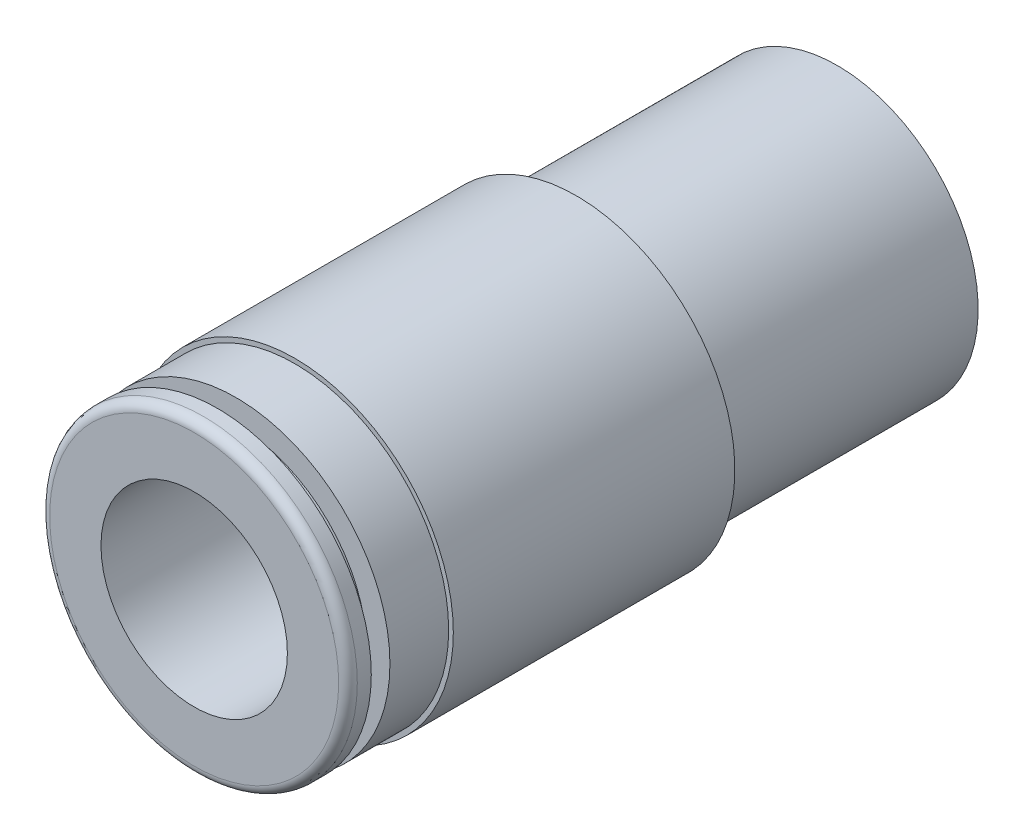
ISO-10303-21;
HEADER;
FILE_DESCRIPTION(('STEP AP214'),'2;1');
FILE_NAME('part.step','',(''),(''),'','','');
FILE_SCHEMA(('AUTOMOTIVE_DESIGN { 1 0 10303 214 1 1 1 1 }'));
ENDSEC;
DATA;
#1=APPLICATION_CONTEXT('core data for automotive mechanical design processes');
#2=APPLICATION_PROTOCOL_DEFINITION('international standard','automotive_design',2000,#1);
#3=PRODUCT_CONTEXT('',#1,'mechanical');
#4=PRODUCT('Part','Part','',(#3));
#5=PRODUCT_RELATED_PRODUCT_CATEGORY('part','',(#4));
#6=PRODUCT_DEFINITION_FORMATION('','',#4);
#7=PRODUCT_DEFINITION_CONTEXT('part definition',#1,'design');
#8=PRODUCT_DEFINITION('design','',#6,#7);
#9=PRODUCT_DEFINITION_SHAPE('','',#8);
#10=(LENGTH_UNIT() NAMED_UNIT(*) SI_UNIT(.MILLI.,.METRE.));
#11=(NAMED_UNIT(*) PLANE_ANGLE_UNIT() SI_UNIT($,.RADIAN.));
#12=(NAMED_UNIT(*) SI_UNIT($,.STERADIAN.) SOLID_ANGLE_UNIT());
#13=UNCERTAINTY_MEASURE_WITH_UNIT(LENGTH_MEASURE(1.E-05),#10,'distance_accuracy_value','');
#14=(GEOMETRIC_REPRESENTATION_CONTEXT(3) GLOBAL_UNCERTAINTY_ASSIGNED_CONTEXT((#13)) GLOBAL_UNIT_ASSIGNED_CONTEXT((#10,
#11,#12)) REPRESENTATION_CONTEXT('',''));
#15=CARTESIAN_POINT('',(0.,0.,0.));
#16=DIRECTION('',(0.,0.,1.));
#17=DIRECTION('',(1.,0.,0.));
#18=AXIS2_PLACEMENT_3D('',#15,#16,#17);
#19=CARTESIAN_POINT('',(0.,0.,0.));
#20=DIRECTION('',(0.,0.,1.));
#21=DIRECTION('',(1.,0.,0.));
#22=AXIS2_PLACEMENT_3D('',#19,#20,#21);
#23=PLANE('',#22);
#24=CARTESIAN_POINT('',(0.,0.,0.));
#25=DIRECTION('',(0.,0.,1.));
#26=DIRECTION('',(1.,0.,0.));
#27=AXIS2_PLACEMENT_3D('',#24,#25,#26);
#28=CIRCLE('',#27,5.);
#29=CARTESIAN_POINT('',(5.,0.,0.));
#30=VERTEX_POINT('',#29);
#31=EDGE_CURVE('E45',#30,#30,#28,.T.);
#32=ORIENTED_EDGE('',*,*,#31,.T.);
#33=EDGE_LOOP('',(#32));
#34=FACE_BOUND('',#33,.T.);
#35=CARTESIAN_POINT('',(0.,0.,0.));
#36=DIRECTION('',(0.,0.,-1.));
#37=DIRECTION('',(-1.,0.,0.));
#38=AXIS2_PLACEMENT_3D('',#35,#36,#37);
#39=CIRCLE('',#38,7.55);
#40=CARTESIAN_POINT('',(-7.55,0.,0.));
#41=VERTEX_POINT('',#40);
#42=EDGE_CURVE('E66',#41,#41,#39,.T.);
#43=ORIENTED_EDGE('',*,*,#42,.T.);
#44=EDGE_LOOP('',(#43));
#45=FACE_BOUND('',#44,.T.);
#46=ADVANCED_FACE('F28',(#34,#45),#23,.F.);
#47=CARTESIAN_POINT('',(0.,0.,29.1));
#48=DIRECTION('',(0.,0.,-1.));
#49=DIRECTION('',(-1.,0.,0.));
#50=AXIS2_PLACEMENT_3D('',#47,#48,#49);
#51=CYLINDRICAL_SURFACE('',#50,8.5);
#52=CARTESIAN_POINT('',(0.,0.,29.1));
#53=DIRECTION('',(0.,0.,1.));
#54=DIRECTION('',(1.,0.,0.));
#55=AXIS2_PLACEMENT_3D('',#52,#53,#54);
#56=CIRCLE('',#55,8.5);
#57=CARTESIAN_POINT('',(8.5,0.,29.1));
#58=VERTEX_POINT('',#57);
#59=EDGE_CURVE('E40',#58,#58,#56,.T.);
#60=ORIENTED_EDGE('',*,*,#59,.F.);
#61=EDGE_LOOP('',(#60));
#62=FACE_BOUND('',#61,.T.);
#63=CARTESIAN_POINT('',(0.,0.,14.));
#64=DIRECTION('',(0.,0.,-1.));
#65=DIRECTION('',(-1.,0.,0.));
#66=AXIS2_PLACEMENT_3D('',#63,#64,#65);
#67=CIRCLE('',#66,8.5);
#68=CARTESIAN_POINT('',(-8.5,0.,14.));
#69=VERTEX_POINT('',#68);
#70=EDGE_CURVE('E32',#69,#69,#67,.T.);
#71=ORIENTED_EDGE('',*,*,#70,.F.);
#72=EDGE_LOOP('',(#71));
#73=FACE_BOUND('',#72,.T.);
#74=ADVANCED_FACE('F78',(#62,#73),#51,.T.);
#75=CARTESIAN_POINT('',(0.,0.,32.25));
#76=DIRECTION('',(0.,0.,1.));
#77=DIRECTION('',(1.,0.,0.));
#78=AXIS2_PLACEMENT_3D('',#75,#76,#77);
#79=PLANE('',#78);
#80=CARTESIAN_POINT('',(0.,0.,32.25));
#81=DIRECTION('',(0.,0.,1.));
#82=DIRECTION('',(1.,0.,0.));
#83=AXIS2_PLACEMENT_3D('',#80,#81,#82);
#84=CIRCLE('',#83,8.25);
#85=CARTESIAN_POINT('',(8.25,0.,32.25));
#86=VERTEX_POINT('',#85);
#87=EDGE_CURVE('E48',#86,#86,#84,.T.);
#88=ORIENTED_EDGE('',*,*,#87,.T.);
#89=EDGE_LOOP('',(#88));
#90=FACE_BOUND('',#89,.T.);
#91=CARTESIAN_POINT('',(0.,0.,32.25));
#92=DIRECTION('',(0.,0.,1.));
#93=DIRECTION('',(1.,0.,0.));
#94=AXIS2_PLACEMENT_3D('',#91,#92,#93);
#95=CIRCLE('',#94,7.);
#96=CARTESIAN_POINT('',(7.,0.,32.25));
#97=VERTEX_POINT('',#96);
#98=EDGE_CURVE('E55',#97,#97,#95,.T.);
#99=ORIENTED_EDGE('',*,*,#98,.F.);
#100=EDGE_LOOP('',(#99));
#101=FACE_BOUND('',#100,.T.);
#102=ADVANCED_FACE('F80',(#90,#101),#79,.T.);
#103=CARTESIAN_POINT('',(0.,0.,29.1));
#104=DIRECTION('',(0.,0.,1.));
#105=DIRECTION('',(1.,0.,0.));
#106=AXIS2_PLACEMENT_3D('',#103,#104,#105);
#107=PLANE('',#106);
#108=ORIENTED_EDGE('',*,*,#59,.T.);
#109=EDGE_LOOP('',(#108));
#110=FACE_BOUND('',#109,.T.);
#111=CARTESIAN_POINT('',(0.,0.,29.1));
#112=DIRECTION('',(0.,0.,1.));
#113=DIRECTION('',(1.,0.,0.));
#114=AXIS2_PLACEMENT_3D('',#111,#112,#113);
#115=CIRCLE('',#114,8.25);
#116=CARTESIAN_POINT('',(8.25,0.,29.1));
#117=VERTEX_POINT('',#116);
#118=EDGE_CURVE('E49',#117,#117,#115,.T.);
#119=ORIENTED_EDGE('',*,*,#118,.F.);
#120=EDGE_LOOP('',(#119));
#121=FACE_BOUND('',#120,.T.);
#122=ADVANCED_FACE('F86',(#110,#121),#107,.T.);
#123=CARTESIAN_POINT('',(0.,0.,29.1));
#124=DIRECTION('',(0.,0.,-1.));
#125=DIRECTION('',(-1.,0.,0.));
#126=AXIS2_PLACEMENT_3D('',#123,#124,#125);
#127=CYLINDRICAL_SURFACE('',#126,5.);
#128=ORIENTED_EDGE('',*,*,#31,.F.);
#129=EDGE_LOOP('',(#128));
#130=FACE_BOUND('',#129,.T.);
#131=CARTESIAN_POINT('',(0.,0.,34.5));
#132=DIRECTION('',(0.,0.,1.));
#133=DIRECTION('',(1.,0.,0.));
#134=AXIS2_PLACEMENT_3D('',#131,#132,#133);
#135=CIRCLE('',#134,5.);
#136=CARTESIAN_POINT('',(5.,0.,34.5));
#137=VERTEX_POINT('',#136);
#138=EDGE_CURVE('E63',#137,#137,#135,.T.);
#139=ORIENTED_EDGE('',*,*,#138,.T.);
#140=EDGE_LOOP('',(#139));
#141=FACE_BOUND('',#140,.T.);
#142=ADVANCED_FACE('F95',(#130,#141),#127,.F.);
#143=CARTESIAN_POINT('',(0.,0.,32.25));
#144=DIRECTION('',(0.,0.,-1.));
#145=DIRECTION('',(-1.,0.,0.));
#146=AXIS2_PLACEMENT_3D('',#143,#144,#145);
#147=CYLINDRICAL_SURFACE('',#146,8.25);
#148=ORIENTED_EDGE('',*,*,#87,.F.);
#149=EDGE_LOOP('',(#148));
#150=FACE_BOUND('',#149,.T.);
#151=ORIENTED_EDGE('',*,*,#118,.T.);
#152=EDGE_LOOP('',(#151));
#153=FACE_BOUND('',#152,.T.);
#154=ADVANCED_FACE('F99',(#150,#153),#147,.T.);
#155=CARTESIAN_POINT('',(0.,0.,33.25));
#156=DIRECTION('',(0.,0.,-1.));
#157=DIRECTION('',(-1.,0.,0.));
#158=AXIS2_PLACEMENT_3D('',#155,#156,#157);
#159=CYLINDRICAL_SURFACE('',#158,7.);
#160=CARTESIAN_POINT('',(0.,0.,33.25));
#161=DIRECTION('',(0.,0.,1.));
#162=DIRECTION('',(1.,0.,0.));
#163=AXIS2_PLACEMENT_3D('',#160,#161,#162);
#164=CIRCLE('',#163,7.);
#165=CARTESIAN_POINT('',(7.,0.,33.25));
#166=VERTEX_POINT('',#165);
#167=EDGE_CURVE('E52',#166,#166,#164,.T.);
#168=ORIENTED_EDGE('',*,*,#167,.F.);
#169=EDGE_LOOP('',(#168));
#170=FACE_BOUND('',#169,.T.);
#171=ORIENTED_EDGE('',*,*,#98,.T.);
#172=EDGE_LOOP('',(#171));
#173=FACE_BOUND('',#172,.T.);
#174=ADVANCED_FACE('F102',(#170,#173),#159,.T.);
#175=CARTESIAN_POINT('',(0.,0.,33.25));
#176=DIRECTION('',(0.,0.,1.));
#177=DIRECTION('',(1.,0.,0.));
#178=AXIS2_PLACEMENT_3D('',#175,#176,#177);
#179=PLANE('',#178);
#180=CARTESIAN_POINT('',(0.,0.,33.25));
#181=DIRECTION('',(0.,0.,1.));
#182=DIRECTION('',(1.,0.,0.));
#183=AXIS2_PLACEMENT_3D('',#180,#181,#182);
#184=CIRCLE('',#183,8.25);
#185=CARTESIAN_POINT('',(8.25,0.,33.25));
#186=VERTEX_POINT('',#185);
#187=EDGE_CURVE('E58',#186,#186,#184,.T.);
#188=ORIENTED_EDGE('',*,*,#187,.F.);
#189=EDGE_LOOP('',(#188));
#190=FACE_BOUND('',#189,.T.);
#191=ORIENTED_EDGE('',*,*,#167,.T.);
#192=EDGE_LOOP('',(#191));
#193=FACE_BOUND('',#192,.T.);
#194=ADVANCED_FACE('F107',(#190,#193),#179,.F.);
#195=CARTESIAN_POINT('',(0.,0.,34.5));
#196=DIRECTION('',(0.,0.,1.));
#197=DIRECTION('',(1.,0.,0.));
#198=AXIS2_PLACEMENT_3D('',#195,#196,#197);
#199=PLANE('',#198);
#200=CARTESIAN_POINT('',(0.,0.,34.5));
#201=DIRECTION('',(0.,0.,1.));
#202=DIRECTION('',(1.,0.,0.));
#203=AXIS2_PLACEMENT_3D('',#200,#201,#202);
#204=CIRCLE('',#203,7.75);
#205=CARTESIAN_POINT('',(7.75,0.,34.5));
#206=VERTEX_POINT('',#205);
#207=EDGE_CURVE('E36',#206,#206,#204,.T.);
#208=ORIENTED_EDGE('',*,*,#207,.T.);
#209=EDGE_LOOP('',(#208));
#210=FACE_BOUND('',#209,.T.);
#211=ORIENTED_EDGE('',*,*,#138,.F.);
#212=EDGE_LOOP('',(#211));
#213=FACE_BOUND('',#212,.T.);
#214=ADVANCED_FACE('F112',(#210,#213),#199,.T.);
#215=CARTESIAN_POINT('',(0.,0.,34.5));
#216=DIRECTION('',(0.,0.,-1.));
#217=DIRECTION('',(-1.,0.,0.));
#218=AXIS2_PLACEMENT_3D('',#215,#216,#217);
#219=CYLINDRICAL_SURFACE('',#218,8.25);
#220=CARTESIAN_POINT('',(0.,0.,34.));
#221=DIRECTION('',(0.,0.,1.));
#222=DIRECTION('',(1.,0.,0.));
#223=AXIS2_PLACEMENT_3D('',#220,#221,#222);
#224=CIRCLE('',#223,8.25);
#225=CARTESIAN_POINT('',(8.25,0.,34.));
#226=VERTEX_POINT('',#225);
#227=EDGE_CURVE('E10',#226,#226,#224,.F.);
#228=ORIENTED_EDGE('',*,*,#227,.T.);
#229=EDGE_LOOP('',(#228));
#230=FACE_BOUND('',#229,.T.);
#231=ORIENTED_EDGE('',*,*,#187,.T.);
#232=EDGE_LOOP('',(#231));
#233=FACE_BOUND('',#232,.T.);
#234=ADVANCED_FACE('F109',(#230,#233),#219,.T.);
#235=CARTESIAN_POINT('',(0.,0.,34.));
#236=DIRECTION('',(0.,0.,1.));
#237=DIRECTION('',(1.,0.,0.));
#238=AXIS2_PLACEMENT_3D('',#235,#236,#237);
#239=TOROIDAL_SURFACE('',#238,7.75,0.5);
#240=ORIENTED_EDGE('',*,*,#227,.F.);
#241=EDGE_LOOP('',(#240));
#242=FACE_BOUND('',#241,.T.);
#243=ORIENTED_EDGE('',*,*,#207,.F.);
#244=EDGE_LOOP('',(#243));
#245=FACE_BOUND('',#244,.T.);
#246=ADVANCED_FACE('F30',(#242,#245),#239,.T.);
#247=CARTESIAN_POINT('',(0.,0.,14.));
#248=DIRECTION('',(0.,0.,-1.));
#249=DIRECTION('',(-1.,0.,0.));
#250=AXIS2_PLACEMENT_3D('',#247,#248,#249);
#251=PLANE('',#250);
#252=CARTESIAN_POINT('',(0.,0.,14.));
#253=DIRECTION('',(0.,0.,-1.));
#254=DIRECTION('',(-1.,0.,0.));
#255=AXIS2_PLACEMENT_3D('',#252,#253,#254);
#256=CIRCLE('',#255,7.55);
#257=CARTESIAN_POINT('',(-7.55,0.,14.));
#258=VERTEX_POINT('',#257);
#259=EDGE_CURVE('E69',#258,#258,#256,.T.);
#260=ORIENTED_EDGE('',*,*,#259,.F.);
#261=EDGE_LOOP('',(#260));
#262=FACE_BOUND('',#261,.T.);
#263=ORIENTED_EDGE('',*,*,#70,.T.);
#264=EDGE_LOOP('',(#263));
#265=FACE_BOUND('',#264,.T.);
#266=ADVANCED_FACE('F76',(#262,#265),#251,.T.);
#267=CARTESIAN_POINT('',(0.,0.,14.));
#268=DIRECTION('',(0.,0.,-1.));
#269=DIRECTION('',(-1.,0.,0.));
#270=AXIS2_PLACEMENT_3D('',#267,#268,#269);
#271=CYLINDRICAL_SURFACE('',#270,7.55);
#272=ORIENTED_EDGE('',*,*,#259,.T.);
#273=EDGE_LOOP('',(#272));
#274=FACE_BOUND('',#273,.T.);
#275=ORIENTED_EDGE('',*,*,#42,.F.);
#276=EDGE_LOOP('',(#275));
#277=FACE_BOUND('',#276,.T.);
#278=ADVANCED_FACE('F121',(#274,#277),#271,.T.);
#279=CLOSED_SHELL('',(#46,#74,#102,#122,#142,#154,#174,#194,#214,#234,#246,#266,#278));
#280=MANIFOLD_SOLID_BREP('B2',#279);
#281=ADVANCED_BREP_SHAPE_REPRESENTATION('',(#18,#280),#14);
#282=SHAPE_DEFINITION_REPRESENTATION(#9,#281);
ENDSEC;
END-ISO-10303-21;
